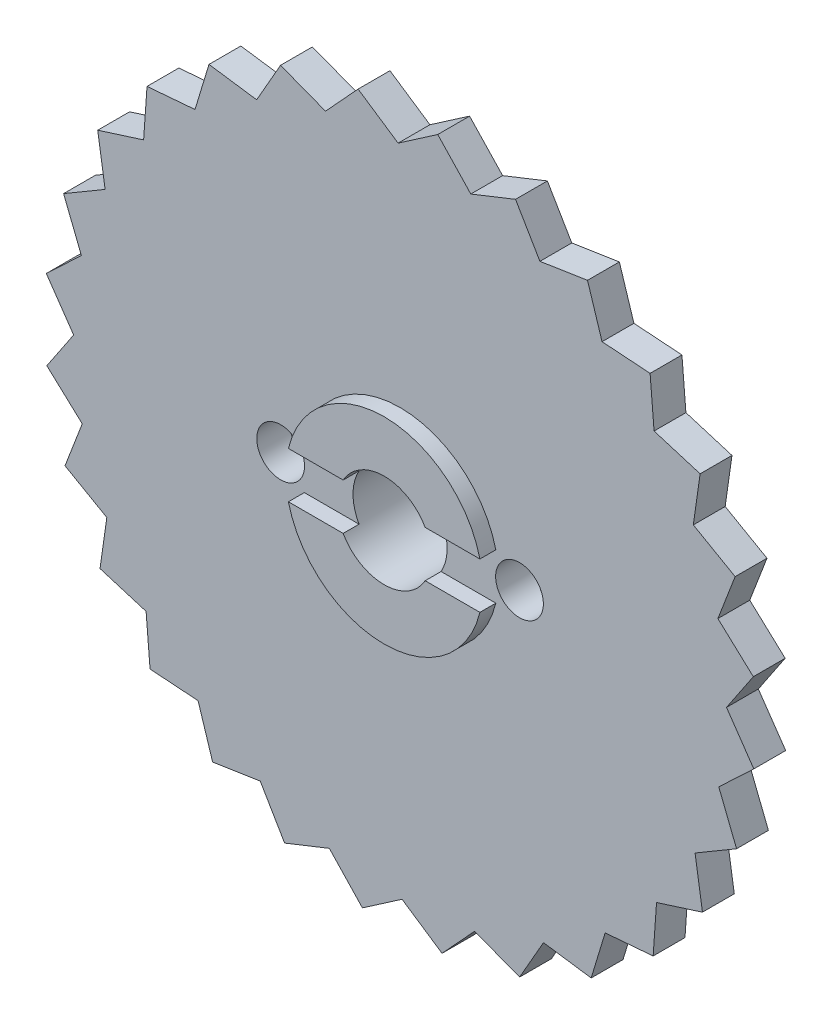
from build123d import *

# Parameters (mm, degrees)
ESQUISSE1_R                   = 22.34
EXTRUSION1_DEPTH              = 9
ENL_V_START                   = -1
ESQUISSE2_R                   = 22.34
ESQUISSE2_R_2                 = 6.185
ENL_V_MAT_EXTRU_1_DEPTH       = 1
ESQUISSE3_R                   = 2.955
ENL_V_MAT_EXTRU_2_DEPTH       = 33.850436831
ESQUISSE4_R                   = 22.34
ESQUISSE4_R_2                 = 8.5
ENL_V_MAT_EXTRU_3_DEPTH       = 6
ESQUISSE5_R                   = 8.5
ESQUISSE5_R_2                 = 6.975
ENL_V_MAT_EXTRU_4_DEPTH       = 1
ESQUISSE6_R                   = 8.5
ESQUISSE6_R_2                 = 5.97
ENL_V_MAT_EXTRU_5_DEPTH       = 3.22
ESQUISSE7_R                   = 8.5
ESQUISSE7_R_2                 = 6.96
ENL_V_MAT_EXTRU_6_DEPTH       = 1.78
ENL_V_MAT_EXTRU_7_DEPTH       = 33.590661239
ENL_V_MAT_EXTRU_14_DEPTH      = 1
ENL_V_MAT_EXTRU_15_DEPTH      = 0.5
ENL_V_MAT_EXTRU_16_DEPTH      = 33.679474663
ENL_V_MAT_EXTRU_16_DEPTH_BACK = 33.679474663
ESQUISSE15_R                  = 1.5
ESQUISSE16_R                  = 1.5
ENL_V_MAT_EXTRU_17_DEPTH      = 10


with BuildPart() as part:
    # Esquisse1 → Extrusion1 (new body)
    with BuildSketch(Plane.XY):
        Circle(ESQUISSE1_R)
    extrude(amount=EXTRUSION1_DEPTH)

    # Esquisse2 → Enl_v. mat.-Extru.1 (cut)
    with BuildSketch(Plane.XY.offset(9).offset(ENL_V_START)):
        Circle(ESQUISSE2_R)
        Circle(ESQUISSE2_R_2, mode=Mode.SUBTRACT)
    extrude(amount=ENL_V_MAT_EXTRU_1_DEPTH, mode=Mode.SUBTRACT)

    # Esquisse3 → Enl_v. mat.-Extru.2 (cut, through all)
    with BuildSketch(Plane.XY.offset(9)):
        Circle(ESQUISSE3_R)
    extrude(amount=-ENL_V_MAT_EXTRU_2_DEPTH, mode=Mode.SUBTRACT)

    # Esquisse4 → Enl_v. mat.-Extru.3 (cut)
    with BuildSketch(Plane(origin=(0, 0, 0), x_dir=(-1, 0, 0), z_dir=(0, 0, -1))):
        Circle(ESQUISSE4_R)
        Circle(ESQUISSE4_R_2, mode=Mode.SUBTRACT)
    extrude(amount=-ENL_V_MAT_EXTRU_3_DEPTH, mode=Mode.SUBTRACT)

    # Esquisse5 → Enl_v. mat.-Extru.4 (cut)
    with BuildSketch(Plane(origin=(0, 0, 0), x_dir=(-1, 0, 0), z_dir=(0, 0, -1))):
        Circle(ESQUISSE5_R)
        Circle(ESQUISSE5_R_2, mode=Mode.SUBTRACT)
    extrude(amount=-ENL_V_MAT_EXTRU_4_DEPTH, mode=Mode.SUBTRACT)

    # Esquisse6 → Enl_v. mat.-Extru.5 (cut)
    with BuildSketch(Plane(origin=(0, 0, 1), x_dir=(-1, 0, 0), z_dir=(0, 0, -1))):
        Circle(ESQUISSE6_R)
        Circle(ESQUISSE6_R_2, mode=Mode.SUBTRACT)
    extrude(amount=-ENL_V_MAT_EXTRU_5_DEPTH, mode=Mode.SUBTRACT)

    # Esquisse7 → Enl_v. mat.-Extru.6 (cut)
    with BuildSketch(Plane(origin=(0, 0, 4.22), x_dir=(-1, 0, 0), z_dir=(0, 0, -1))):
        Circle(ESQUISSE7_R)
        Circle(ESQUISSE7_R_2, mode=Mode.SUBTRACT)
    extrude(amount=-ENL_V_MAT_EXTRU_6_DEPTH, mode=Mode.SUBTRACT)

    # Esquisse9 → Enl_v. mat.-Extru.7 (cut, through all)
    with BuildSketch(Plane.XY.offset(8)):
        with BuildLine():
            Line((-22.183971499, -2.635717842), (-20.49962387, -0.12418215))
            Line((-20.49962387, -0.12418215), (-22.214275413, 2.366763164))
            ThreePointArc((-22.214275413, 2.366763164), (-22.33959011, -0.135328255), (-22.183971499, -2.635717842))
        make_face()
        with BuildLine():
            Line((-19.958022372, -4.682664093), (-22.183971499, -2.635717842))
            ThreePointArc((-22.183971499, -2.635717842), (-21.749376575, -5.102961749), (-21.041270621, -7.50603295))
            Line((-21.041270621, -7.50603295), (-19.958022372, -4.682664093))
        make_face()
        with BuildLine():
            ThreePointArc((-21.130662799, 7.250564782), (-21.809603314, 4.839091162), (-22.214275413, 2.366763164))
            Line((-22.214275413, 2.366763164), (-20.013288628, 4.440526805))
            Line((-20.013288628, 4.440526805), (-21.130662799, 7.250564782))
        make_face()
        with BuildLine():
            Line((-18.415642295, -9.006337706), (-21.041270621, -7.50603295))
            ThreePointArc((-21.041270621, -7.50603295), (-20.068558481, -9.814711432), (-18.843472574, -11.999964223))
            Line((-18.843472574, -11.999964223), (-18.415642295, -9.006337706))
        make_face()
        with BuildLine():
            ThreePointArc((-18.987470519, 11.770792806), (-20.18599194, 9.570858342), (-21.130662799, 7.250564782))
            Line((-21.130662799, 7.250564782), (-18.523403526, 8.782569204))
            Line((-18.523403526, 8.782569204), (-18.987470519, 11.770792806))
        make_face()
        with BuildLine():
            Line((-15.949825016, -12.878395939), (-18.843472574, -11.999964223))
            ThreePointArc((-18.843472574, -11.999964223), (-17.381419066, -14.034310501), (-15.700784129, -15.892167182))
            Line((-15.700784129, -15.892167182), (-15.949825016, -12.878395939))
        make_face()
        with BuildLine():
            ThreePointArc((-15.892167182, 15.700784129), (-17.55017064, 13.822702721), (-18.987470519, 11.770792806))
            Line((-18.987470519, 11.770792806), (-16.104677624, 12.68421691))
            Line((-16.104677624, 12.68421691), (-15.892167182, 15.700784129))
        make_face()
        with BuildLine():
            Line((-12.68421691, -16.104677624), (-15.700784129, -15.892167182))
            ThreePointArc((-15.700784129, -15.892167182), (-13.822702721, -17.55017064), (-11.770792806, -18.987470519))
            Line((-11.770792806, -18.987470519), (-12.68421691, -16.104677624))
        make_face()
        with BuildLine():
            ThreePointArc((-11.999964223, 18.843472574), (-14.034310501, 17.381419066), (-15.892167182, 15.700784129))
            Line((-15.892167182, 15.700784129), (-12.878395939, 15.949825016))
            Line((-12.878395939, 15.949825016), (-11.999964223, 18.843472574))
        make_face()
        with BuildLine():
            Line((-8.782569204, -18.523403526), (-11.770792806, -18.987470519))
            ThreePointArc((-11.770792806, -18.987470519), (-9.570858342, -20.18599194), (-7.250564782, -21.130662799))
            Line((-7.250564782, -21.130662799), (-8.782569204, -18.523403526))
        make_face()
        with BuildLine():
            ThreePointArc((-7.50603295, 21.041270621), (-9.814711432, 20.068558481), (-11.999964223, 18.843472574))
            Line((-11.999964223, 18.843472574), (-9.006337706, 18.415642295))
            Line((-9.006337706, 18.415642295), (-7.50603295, 21.041270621))
        make_face()
        with BuildLine():
            Line((-4.440526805, -20.013288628), (-7.250564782, -21.130662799))
            ThreePointArc((-7.250564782, -21.130662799), (-4.839091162, -21.809603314), (-2.366763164, -22.214275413))
            Line((-2.366763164, -22.214275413), (-4.440526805, -20.013288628))
        make_face()
        with BuildLine():
            ThreePointArc((-2.635717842, 22.183971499), (-5.102961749, 21.749376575), (-7.50603295, 21.041270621))
            Line((-7.50603295, 21.041270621), (-4.682664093, 19.958022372))
            Line((-4.682664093, 19.958022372), (-2.635717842, 22.183971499))
        make_face()
        with BuildLine():
            Line((0.12418215, -20.49962387), (-2.366763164, -22.214275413))
            ThreePointArc((-2.366763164, -22.214275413), (0.135328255, -22.33959011), (2.635717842, -22.183971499))
            Line((2.635717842, -22.183971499), (0.12418215, -20.49962387))
        make_face()
        with BuildLine():
            ThreePointArc((2.366763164, 22.214275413), (-0.135328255, 22.33959011), (-2.635717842, 22.183971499))
            Line((-2.635717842, 22.183971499), (-0.12418215, 20.49962387))
            Line((-0.12418215, 20.49962387), (2.366763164, 22.214275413))
        make_face()
        with BuildLine():
            Line((4.682664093, -19.958022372), (2.635717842, -22.183971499))
            ThreePointArc((2.635717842, -22.183971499), (5.102961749, -21.749376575), (7.50603295, -21.041270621))
            Line((7.50603295, -21.041270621), (4.682664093, -19.958022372))
        make_face()
        with BuildLine():
            ThreePointArc((7.250564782, 21.130662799), (4.839091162, 21.809603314), (2.366763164, 22.214275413))
            Line((2.366763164, 22.214275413), (4.440526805, 20.013288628))
            Line((4.440526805, 20.013288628), (7.250564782, 21.130662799))
        make_face()
        with BuildLine():
            Line((9.006337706, -18.415642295), (7.50603295, -21.041270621))
            ThreePointArc((7.50603295, -21.041270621), (9.814711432, -20.068558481), (11.999964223, -18.843472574))
            Line((11.999964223, -18.843472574), (9.006337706, -18.415642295))
        make_face()
        with BuildLine():
            ThreePointArc((11.770792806, 18.987470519), (9.570858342, 20.18599194), (7.250564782, 21.130662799))
            Line((7.250564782, 21.130662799), (8.782569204, 18.523403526))
            Line((8.782569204, 18.523403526), (11.770792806, 18.987470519))
        make_face()
        with BuildLine():
            Line((12.878395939, -15.949825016), (11.999964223, -18.843472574))
            ThreePointArc((11.999964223, -18.843472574), (14.034310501, -17.381419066), (15.892167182, -15.700784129))
            Line((15.892167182, -15.700784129), (12.878395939, -15.949825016))
        make_face()
        with BuildLine():
            ThreePointArc((15.700784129, 15.892167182), (13.822702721, 17.55017064), (11.770792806, 18.987470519))
            Line((11.770792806, 18.987470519), (12.68421691, 16.104677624))
            Line((12.68421691, 16.104677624), (15.700784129, 15.892167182))
        make_face()
        with BuildLine():
            Line((16.104677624, -12.68421691), (15.892167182, -15.700784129))
            ThreePointArc((15.892167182, -15.700784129), (17.55017064, -13.822702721), (18.987470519, -11.770792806))
            Line((18.987470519, -11.770792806), (16.104677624, -12.68421691))
        make_face()
        with BuildLine():
            ThreePointArc((18.843472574, 11.999964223), (17.381419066, 14.034310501), (15.700784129, 15.892167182))
            Line((15.700784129, 15.892167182), (15.949825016, 12.878395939))
            Line((15.949825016, 12.878395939), (18.843472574, 11.999964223))
        make_face()
        with BuildLine():
            Line((18.523403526, -8.782569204), (18.987470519, -11.770792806))
            ThreePointArc((18.987470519, -11.770792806), (20.18599194, -9.570858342), (21.130662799, -7.250564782))
            Line((21.130662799, -7.250564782), (18.523403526, -8.782569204))
        make_face()
        with BuildLine():
            ThreePointArc((21.041270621, 7.50603295), (20.068558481, 9.814711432), (18.843472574, 11.999964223))
            Line((18.843472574, 11.999964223), (18.415642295, 9.006337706))
            Line((18.415642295, 9.006337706), (21.041270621, 7.50603295))
        make_face()
        with BuildLine():
            Line((20.013288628, -4.440526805), (21.130662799, -7.250564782))
            ThreePointArc((21.130662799, -7.250564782), (21.809603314, -4.839091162), (22.214275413, -2.366763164))
            Line((22.214275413, -2.366763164), (20.013288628, -4.440526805))
        make_face()
        with BuildLine():
            ThreePointArc((22.183971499, 2.635717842), (21.749376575, 5.102961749), (21.041270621, 7.50603295))
            Line((21.041270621, 7.50603295), (19.958022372, 4.682664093))
            Line((19.958022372, 4.682664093), (22.183971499, 2.635717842))
        make_face()
        with BuildLine():
            Line((20.49962387, 0.12418215), (22.214275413, -2.366763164))
            ThreePointArc((22.214275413, -2.366763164), (22.33959011, 0.135328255), (22.183971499, 2.635717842))
            Line((22.183971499, 2.635717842), (20.49962387, 0.12418215))
        make_face()
    extrude(amount=-ENL_V_MAT_EXTRU_7_DEPTH, mode=Mode.SUBTRACT)

    # Esquisse13 → Enl_v. mat.-Extru.14 (cut)
    with BuildSketch(Plane.XY.offset(9)):
        Polygon((6.185, 0), (6.185, 1.45), (-6.185, 1.45), (-6.185, 0), (-6.185, -1.45), (6.185, -1.45), align=None)
    extrude(amount=-ENL_V_MAT_EXTRU_14_DEPTH, mode=Mode.SUBTRACT)

    # Esquisse14 → Enl_v. mat.-Extru.15 (cut)
    with BuildSketch(Plane(origin=(0, 0, 0), x_dir=(-1, 0, 0), z_dir=(0, 0, -1))):
        Polygon((6.975, 0), (6.975, 1.45), (-6.975, 1.45), (-6.975, -1.45), (6.975, -1.45), align=None)
    extrude(amount=-ENL_V_MAT_EXTRU_15_DEPTH, mode=Mode.SUBTRACT)

    # Esquisse15 → Enl_v. mat.-Extru.16 (cut, two sides: drawn at the far end of the back side and taken through both)
    with BuildSketch(Plane(origin=(0, 0, 0), x_dir=(0, 0, -1), z_dir=(1, 0, 0)).offset(-ENL_V_MAT_EXTRU_16_DEPTH_BACK)):
        with Locations((-2.61, 0)):
            Circle(ESQUISSE15_R)
    extrude(amount=ENL_V_MAT_EXTRU_16_DEPTH + ENL_V_MAT_EXTRU_16_DEPTH_BACK, mode=Mode.SUBTRACT)

    # Esquisse16 → Enl_v. mat.-Extru.17 (cut)
    with BuildSketch(Plane.XY.offset(8)):
        with Locations((-7.5, 0)):
            Circle(ESQUISSE16_R)
        with Locations(Location((7.5, 0, 0), (0, 0, 116.553931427))):
            Circle(ESQUISSE16_R)
    extrude(amount=-ENL_V_MAT_EXTRU_17_DEPTH, mode=Mode.SUBTRACT)


solid = part.part
